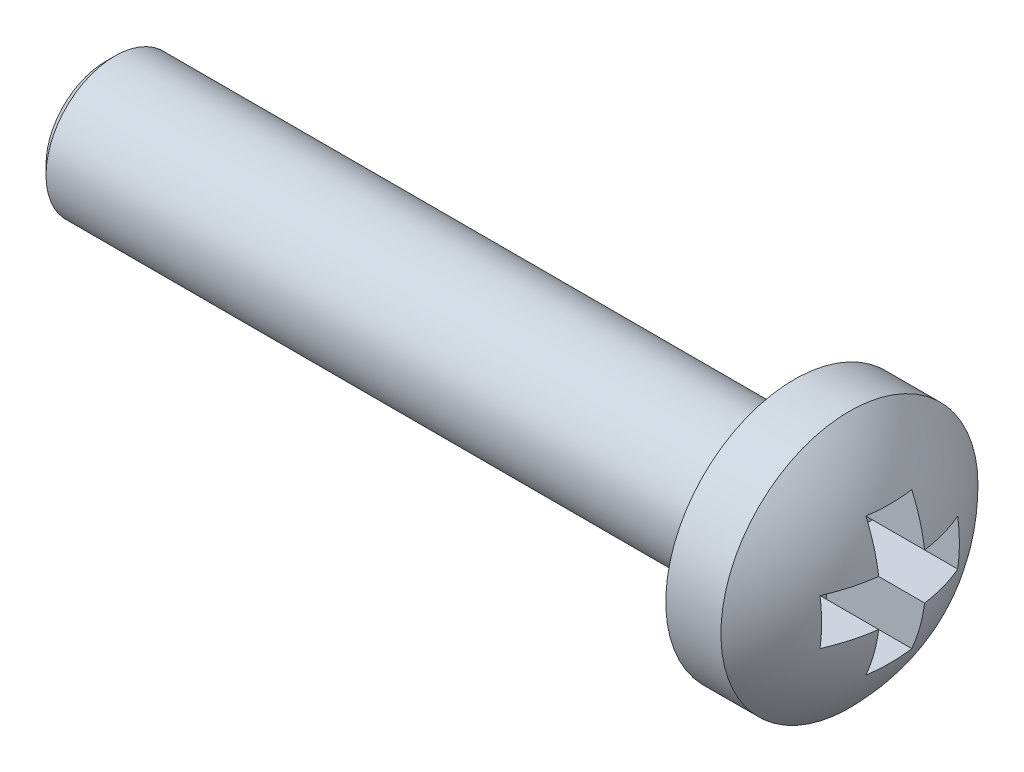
ISO-10303-21;
HEADER;
FILE_DESCRIPTION(('STEP AP214'),'2;1');
FILE_NAME('part.step','',(''),(''),'','','');
FILE_SCHEMA(('AUTOMOTIVE_DESIGN { 1 0 10303 214 1 1 1 1 }'));
ENDSEC;
DATA;
#1=APPLICATION_CONTEXT('core data for automotive mechanical design processes');
#2=APPLICATION_PROTOCOL_DEFINITION('international standard','automotive_design',2000,#1);
#3=PRODUCT_CONTEXT('',#1,'mechanical');
#4=PRODUCT('Part','Part','',(#3));
#5=PRODUCT_RELATED_PRODUCT_CATEGORY('part','',(#4));
#6=PRODUCT_DEFINITION_FORMATION('','',#4);
#7=PRODUCT_DEFINITION_CONTEXT('part definition',#1,'design');
#8=PRODUCT_DEFINITION('design','',#6,#7);
#9=PRODUCT_DEFINITION_SHAPE('','',#8);
#10=(LENGTH_UNIT() NAMED_UNIT(*) SI_UNIT(.MILLI.,.METRE.));
#11=(NAMED_UNIT(*) PLANE_ANGLE_UNIT() SI_UNIT($,.RADIAN.));
#12=(NAMED_UNIT(*) SI_UNIT($,.STERADIAN.) SOLID_ANGLE_UNIT());
#13=UNCERTAINTY_MEASURE_WITH_UNIT(LENGTH_MEASURE(1.E-05),#10,'distance_accuracy_value','');
#14=(GEOMETRIC_REPRESENTATION_CONTEXT(3) GLOBAL_UNCERTAINTY_ASSIGNED_CONTEXT((#13)) GLOBAL_UNIT_ASSIGNED_CONTEXT((#10,
#11,#12)) REPRESENTATION_CONTEXT('',''));
#15=CARTESIAN_POINT('',(0.,0.,0.));
#16=DIRECTION('',(0.,0.,1.));
#17=DIRECTION('',(1.,0.,0.));
#18=AXIS2_PLACEMENT_3D('',#15,#16,#17);
#19=CARTESIAN_POINT('',(2.4,0.,0.));
#20=CARTESIAN_POINT('',(2.4,-1.57169168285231,0.));
#21=CARTESIAN_POINT('',(1.2,-2.8,0.));
#22=B_SPLINE_CURVE_WITH_KNOTS('',2,(#19,#20,#21),.UNSPECIFIED.,.F.,.F.,(3,3),(0.,1.),.UNSPECIFIED.);
#23=CARTESIAN_POINT('',(11.0618266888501,0.,0.));
#24=DIRECTION('',(1.,0.,0.));
#25=AXIS1_PLACEMENT('',#23,#24);
#26=SURFACE_OF_REVOLUTION('',#22,#25);
#27=CARTESIAN_POINT('',(1.2,0.,0.));
#28=DIRECTION('',(1.,0.,0.));
#29=DIRECTION('',(0.,0.,-1.));
#30=AXIS2_PLACEMENT_3D('',#27,#28,#29);
#31=CIRCLE('',#30,2.8);
#32=CARTESIAN_POINT('',(1.2,0.,-2.8));
#33=VERTEX_POINT('',#32);
#34=EDGE_CURVE('E265',#33,#33,#31,.T.);
#35=ORIENTED_EDGE('',*,*,#34,.T.);
#36=EDGE_LOOP('',(#35));
#37=FACE_BOUND('',#36,.T.);
#38=CARTESIAN_POINT('',(2.05758661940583,0.500000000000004,1.49999999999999));
#39=CARTESIAN_POINT('',(2.08308448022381,0.500000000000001,1.44179657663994));
#40=CARTESIAN_POINT('',(2.10709470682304,0.5,1.38295700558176));
#41=CARTESIAN_POINT('',(2.1520554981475,0.5,1.26410705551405));
#42=CARTESIAN_POINT('',(2.17300544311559,0.5,1.204096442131));
#43=CARTESIAN_POINT('',(2.23082558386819,0.5,1.02342732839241));
#44=CARTESIAN_POINT('',(2.2630608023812,0.499999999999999,0.901232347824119));
#45=CARTESIAN_POINT('',(2.29852160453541,0.499999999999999,0.731861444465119));
#46=CARTESIAN_POINT('',(2.30725171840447,0.5,0.685768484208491));
#47=CARTESIAN_POINT('',(2.3229806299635,0.5,0.593159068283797));
#48=CARTESIAN_POINT('',(2.32997465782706,0.5,0.546641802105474));
#49=CARTESIAN_POINT('',(2.33609517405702,0.5,0.500000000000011));
#50=B_SPLINE_CURVE_WITH_KNOTS('',3,(#38,#39,#40,#41,#42,#43,#44,#45,#46,#47,#48,#49),
.UNSPECIFIED.,.F.,.F.,(4,2,2,2,2,4),(0.,0.190580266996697,0.381199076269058,0.759504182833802,
0.900218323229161,1.04131489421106),.UNSPECIFIED.);
#51=CARTESIAN_POINT('',(2.05758661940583,0.5,1.5));
#52=VERTEX_POINT('',#51);
#53=CARTESIAN_POINT('',(2.33609517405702,0.5,0.500000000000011));
#54=VERTEX_POINT('',#53);
#55=EDGE_CURVE('E167',#52,#54,#50,.T.);
#56=ORIENTED_EDGE('',*,*,#55,.T.);
#57=CARTESIAN_POINT('',(2.33609517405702,0.5,0.500000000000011));
#58=CARTESIAN_POINT('',(2.32797490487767,0.561927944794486,0.500000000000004));
#59=CARTESIAN_POINT('',(2.31830112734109,0.623654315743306,0.500000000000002));
#60=CARTESIAN_POINT('',(2.29584316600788,0.746540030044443,0.499999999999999));
#61=CARTESIAN_POINT('',(2.28305889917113,0.807699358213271,0.5));
#62=CARTESIAN_POINT('',(2.25447928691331,0.928850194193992,0.500000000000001));
#63=CARTESIAN_POINT('',(2.23870606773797,0.988846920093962,0.500000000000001));
#64=CARTESIAN_POINT('',(2.20412521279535,1.10795747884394,0.5));
#65=CARTESIAN_POINT('',(2.1853177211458,1.16707135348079,0.5));
#66=CARTESIAN_POINT('',(2.14895095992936,1.27208335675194,0.5));
#67=CARTESIAN_POINT('',(2.13194503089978,1.3181740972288,0.5));
#68=CARTESIAN_POINT('',(2.09611683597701,1.40963903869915,0.500000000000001));
#69=CARTESIAN_POINT('',(2.07729474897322,1.45501330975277,0.500000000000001));
#70=CARTESIAN_POINT('',(2.05758661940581,1.5,0.5));
#71=B_SPLINE_CURVE_WITH_KNOTS('',3,(#57,#58,#59,#60,#61,#62,#63,#64,#65,#66,#67,#68,#69,#70),
.UNSPECIFIED.,.F.,.F.,(4,2,2,2,2,2,4),(0.,0.187357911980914,0.374720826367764,0.560747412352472,
0.746765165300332,0.894111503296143,1.0414433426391),.UNSPECIFIED.);
#72=CARTESIAN_POINT('',(2.05758661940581,1.5,0.5));
#73=VERTEX_POINT('',#72);
#74=EDGE_CURVE('E11',#54,#73,#71,.T.);
#75=ORIENTED_EDGE('',*,*,#74,.T.);
#76=CARTESIAN_POINT('',(2.05758661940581,1.5,0.500000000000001));
#77=CARTESIAN_POINT('',(2.07601190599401,1.5,0.374107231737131));
#78=CARTESIAN_POINT('',(2.08741865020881,1.5,0.247173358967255));
#79=CARTESIAN_POINT('',(2.09618340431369,1.5,-0.00617564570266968));
#80=CARTESIAN_POINT('',(2.09365159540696,1.5,-0.132586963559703));
#81=CARTESIAN_POINT('',(2.07818848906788,1.5,-0.339263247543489));
#82=CARTESIAN_POINT('',(2.0693049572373,1.5,-0.419846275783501));
#83=CARTESIAN_POINT('',(2.05758661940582,1.5,-0.499999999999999));
#84=B_SPLINE_CURVE_WITH_KNOTS('',3,(#76,#77,#78,#79,#80,#81,#82,#83),.UNSPECIFIED.,.F.,.F.,(4,2,
2,4),(0.,0.381541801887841,0.760071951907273,1.00308018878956),.UNSPECIFIED.);
#85=CARTESIAN_POINT('',(2.05758661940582,1.5,-0.5));
#86=VERTEX_POINT('',#85);
#87=EDGE_CURVE('E45',#73,#86,#84,.T.);
#88=ORIENTED_EDGE('',*,*,#87,.T.);
#89=CARTESIAN_POINT('',(2.05758661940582,1.5,-0.499999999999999));
#90=CARTESIAN_POINT('',(2.08308448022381,1.44179657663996,-0.499999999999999));
#91=CARTESIAN_POINT('',(2.10709470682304,1.38295700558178,-0.5));
#92=CARTESIAN_POINT('',(2.1520554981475,1.26410705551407,-0.5));
#93=CARTESIAN_POINT('',(2.17300544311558,1.20409644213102,-0.5));
#94=CARTESIAN_POINT('',(2.23082558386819,1.02342732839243,-0.499999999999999));
#95=CARTESIAN_POINT('',(2.2630608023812,0.901232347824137,-0.499999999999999));
#96=CARTESIAN_POINT('',(2.29852160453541,0.731861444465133,-0.499999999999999));
#97=CARTESIAN_POINT('',(2.30725171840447,0.685768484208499,-0.499999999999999));
#98=CARTESIAN_POINT('',(2.3229806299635,0.593159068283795,-0.5));
#99=CARTESIAN_POINT('',(2.32997465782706,0.546641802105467,-0.5));
#100=CARTESIAN_POINT('',(2.33609517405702,0.5,-0.5));
#101=B_SPLINE_CURVE_WITH_KNOTS('',3,(#89,#90,#91,#92,#93,#94,#95,#96,#97,#98,#99,#100),
.UNSPECIFIED.,.F.,.F.,(4,2,2,2,2,4),(0.,0.190580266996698,0.381199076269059,0.759504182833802,
0.900218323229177,1.04131489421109),.UNSPECIFIED.);
#102=CARTESIAN_POINT('',(2.33609517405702,0.5,-0.5));
#103=VERTEX_POINT('',#102);
#104=EDGE_CURVE('E231',#86,#103,#101,.T.);
#105=ORIENTED_EDGE('',*,*,#104,.T.);
#106=CARTESIAN_POINT('',(2.33609517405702,0.5,-0.5));
#107=CARTESIAN_POINT('',(2.32797490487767,0.5,-0.561927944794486));
#108=CARTESIAN_POINT('',(2.31830112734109,0.5,-0.623654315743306));
#109=CARTESIAN_POINT('',(2.29584316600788,0.5,-0.746540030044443));
#110=CARTESIAN_POINT('',(2.28305889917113,0.5,-0.807699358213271));
#111=CARTESIAN_POINT('',(2.25447928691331,0.5,-0.928850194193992));
#112=CARTESIAN_POINT('',(2.23870606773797,0.5,-0.988846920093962));
#113=CARTESIAN_POINT('',(2.20412521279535,0.5,-1.10795747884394));
#114=CARTESIAN_POINT('',(2.1853177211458,0.5,-1.16707135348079));
#115=CARTESIAN_POINT('',(2.14895095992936,0.5,-1.27208335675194));
#116=CARTESIAN_POINT('',(2.13194503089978,0.5,-1.31817409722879));
#117=CARTESIAN_POINT('',(2.09611683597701,0.5,-1.40963903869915));
#118=CARTESIAN_POINT('',(2.07729474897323,0.5,-1.45501330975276));
#119=CARTESIAN_POINT('',(2.05758661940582,0.5,-1.49999999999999));
#120=B_SPLINE_CURVE_WITH_KNOTS('',3,(#106,#107,#108,#109,#110,#111,#112,#113,#114,#115,#116,
#117,#118,#119),.UNSPECIFIED.,.F.,.F.,(4,2,2,2,2,2,4),(0.,0.187357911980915,0.374720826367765,
0.560747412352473,0.746765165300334,0.894111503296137,1.04144334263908),.UNSPECIFIED.);
#121=CARTESIAN_POINT('',(2.05758661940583,0.5,-1.5));
#122=VERTEX_POINT('',#121);
#123=EDGE_CURVE('E225',#103,#122,#120,.T.);
#124=ORIENTED_EDGE('',*,*,#123,.T.);
#125=CARTESIAN_POINT('',(2.05758661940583,0.500000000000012,-1.49999999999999));
#126=CARTESIAN_POINT('',(2.07601190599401,0.374107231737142,-1.5));
#127=CARTESIAN_POINT('',(2.0874186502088,0.247173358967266,-1.5));
#128=CARTESIAN_POINT('',(2.09618340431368,-0.00617564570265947,-1.5));
#129=CARTESIAN_POINT('',(2.09365159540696,-0.132586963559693,-1.5));
#130=CARTESIAN_POINT('',(2.07818848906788,-0.339263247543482,-1.5));
#131=CARTESIAN_POINT('',(2.0693049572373,-0.419846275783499,-1.5));
#132=CARTESIAN_POINT('',(2.05758661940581,-0.500000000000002,-1.5));
#133=B_SPLINE_CURVE_WITH_KNOTS('',3,(#125,#126,#127,#128,#129,#130,#131,#132),.UNSPECIFIED.,.F.,
.F.,(4,2,2,4),(0.,0.38154180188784,0.760071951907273,1.00308018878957),.UNSPECIFIED.);
#134=CARTESIAN_POINT('',(2.05758661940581,-0.5,-1.5));
#135=VERTEX_POINT('',#134);
#136=EDGE_CURVE('E218',#122,#135,#133,.T.);
#137=ORIENTED_EDGE('',*,*,#136,.T.);
#138=CARTESIAN_POINT('',(2.05758661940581,-0.500000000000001,-1.5));
#139=CARTESIAN_POINT('',(2.0830844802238,-0.5,-1.44179657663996));
#140=CARTESIAN_POINT('',(2.10709470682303,-0.5,-1.38295700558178));
#141=CARTESIAN_POINT('',(2.1520554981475,-0.5,-1.26410705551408));
#142=CARTESIAN_POINT('',(2.17300544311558,-0.5,-1.20409644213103));
#143=CARTESIAN_POINT('',(2.23082558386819,-0.5,-1.02342732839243));
#144=CARTESIAN_POINT('',(2.2630608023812,-0.499999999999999,-0.901232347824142));
#145=CARTESIAN_POINT('',(2.29852160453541,-0.5,-0.731861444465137));
#146=CARTESIAN_POINT('',(2.30725171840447,-0.5,-0.685768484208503));
#147=CARTESIAN_POINT('',(2.3229806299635,-0.5,-0.593159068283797));
#148=CARTESIAN_POINT('',(2.32997465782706,-0.5,-0.546641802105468));
#149=CARTESIAN_POINT('',(2.33609517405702,-0.5,-0.5));
#150=B_SPLINE_CURVE_WITH_KNOTS('',3,(#138,#139,#140,#141,#142,#143,#144,#145,#146,#147,#148,
#149),.UNSPECIFIED.,.F.,.F.,(4,2,2,2,2,4),(0.,0.190580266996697,0.381199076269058,
0.759504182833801,0.900218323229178,1.0413148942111),.UNSPECIFIED.);
#151=CARTESIAN_POINT('',(2.33609517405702,-0.5,-0.5));
#152=VERTEX_POINT('',#151);
#153=EDGE_CURVE('E211',#135,#152,#150,.T.);
#154=ORIENTED_EDGE('',*,*,#153,.T.);
#155=CARTESIAN_POINT('',(2.33609517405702,-0.5,-0.5));
#156=CARTESIAN_POINT('',(2.32797490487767,-0.561927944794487,-0.5));
#157=CARTESIAN_POINT('',(2.31830112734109,-0.623654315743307,-0.5));
#158=CARTESIAN_POINT('',(2.29584316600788,-0.746540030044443,-0.5));
#159=CARTESIAN_POINT('',(2.28305889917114,-0.807699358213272,-0.5));
#160=CARTESIAN_POINT('',(2.25447928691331,-0.928850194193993,-0.5));
#161=CARTESIAN_POINT('',(2.23870606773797,-0.988846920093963,-0.5));
#162=CARTESIAN_POINT('',(2.20412521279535,-1.10795747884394,-0.5));
#163=CARTESIAN_POINT('',(2.1853177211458,-1.16707135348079,-0.5));
#164=CARTESIAN_POINT('',(2.14895095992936,-1.27208335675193,-0.5));
#165=CARTESIAN_POINT('',(2.13194503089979,-1.31817409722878,-0.5));
#166=CARTESIAN_POINT('',(2.09611683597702,-1.40963903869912,-0.499999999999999));
#167=CARTESIAN_POINT('',(2.07729474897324,-1.45501330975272,-0.499999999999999));
#168=CARTESIAN_POINT('',(2.05758661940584,-1.49999999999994,-0.499999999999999));
#169=B_SPLINE_CURVE_WITH_KNOTS('',3,(#155,#156,#157,#158,#159,#160,#161,#162,#163,#164,#165,
#166,#167,#168),.UNSPECIFIED.,.F.,.F.,(4,2,2,2,2,2,4),(0.,0.187357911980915,0.374720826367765,
0.560747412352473,0.746765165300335,0.894111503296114,1.04144334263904),.UNSPECIFIED.);
#170=CARTESIAN_POINT('',(2.05758661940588,-1.5,-0.5));
#171=VERTEX_POINT('',#170);
#172=EDGE_CURVE('E204',#152,#171,#169,.T.);
#173=ORIENTED_EDGE('',*,*,#172,.T.);
#174=CARTESIAN_POINT('',(2.05758661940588,-1.49999999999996,-0.499999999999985));
#175=CARTESIAN_POINT('',(2.07601190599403,-1.49999999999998,-0.374107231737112));
#176=CARTESIAN_POINT('',(2.08741865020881,-1.5,-0.247173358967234));
#177=CARTESIAN_POINT('',(2.09618340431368,-1.5,0.00617564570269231));
#178=CARTESIAN_POINT('',(2.09365159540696,-1.5,0.132586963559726));
#179=CARTESIAN_POINT('',(2.07818848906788,-1.5,0.339263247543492));
#180=CARTESIAN_POINT('',(2.06930495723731,-1.5,0.419846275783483));
#181=CARTESIAN_POINT('',(2.05758661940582,-1.5,0.499999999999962));
#182=B_SPLINE_CURVE_WITH_KNOTS('',3,(#174,#175,#176,#177,#178,#179,#180,#181),.UNSPECIFIED.,.F.,
.F.,(4,2,2,4),(0.,0.38154180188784,0.760071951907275,1.0030801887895),.UNSPECIFIED.);
#183=CARTESIAN_POINT('',(2.05758661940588,-1.5,0.5));
#184=VERTEX_POINT('',#183);
#185=EDGE_CURVE('E197',#171,#184,#182,.T.);
#186=ORIENTED_EDGE('',*,*,#185,.T.);
#187=CARTESIAN_POINT('',(2.05758661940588,-1.49999999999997,0.499999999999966));
#188=CARTESIAN_POINT('',(2.08308448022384,-1.44179657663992,0.499999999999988));
#189=CARTESIAN_POINT('',(2.10709470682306,-1.38295700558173,0.499999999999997));
#190=CARTESIAN_POINT('',(2.15205549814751,-1.26410705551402,0.500000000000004));
#191=CARTESIAN_POINT('',(2.1730054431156,-1.20409644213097,0.500000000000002));
#192=CARTESIAN_POINT('',(2.2308255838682,-1.02342732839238,0.499999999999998));
#193=CARTESIAN_POINT('',(2.26306080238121,-0.901232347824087,0.499999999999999));
#194=CARTESIAN_POINT('',(2.29852160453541,-0.73186144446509,0.5));
#195=CARTESIAN_POINT('',(2.30725171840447,-0.685768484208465,0.5));
#196=CARTESIAN_POINT('',(2.3229806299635,-0.593159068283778,0.500000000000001));
#197=CARTESIAN_POINT('',(2.32997465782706,-0.546641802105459,0.500000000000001));
#198=CARTESIAN_POINT('',(2.33609517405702,-0.5,0.5));
#199=B_SPLINE_CURVE_WITH_KNOTS('',3,(#187,#188,#189,#190,#191,#192,#193,#194,#195,#196,#197,
#198),.UNSPECIFIED.,.F.,.F.,(4,2,2,2,2,4),(0.,0.190580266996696,0.381199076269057,
0.759504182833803,0.900218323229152,1.04131489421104),.UNSPECIFIED.);
#200=CARTESIAN_POINT('',(2.33609517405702,-0.5,0.5));
#201=VERTEX_POINT('',#200);
#202=EDGE_CURVE('E190',#184,#201,#199,.T.);
#203=ORIENTED_EDGE('',*,*,#202,.T.);
#204=CARTESIAN_POINT('',(2.33609517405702,-0.5,0.5));
#205=CARTESIAN_POINT('',(2.32797490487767,-0.5,0.561927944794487));
#206=CARTESIAN_POINT('',(2.31830112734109,-0.5,0.623654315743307));
#207=CARTESIAN_POINT('',(2.29584316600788,-0.5,0.746540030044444));
#208=CARTESIAN_POINT('',(2.28305889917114,-0.5,0.807699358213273));
#209=CARTESIAN_POINT('',(2.25447928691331,-0.5,0.928850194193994));
#210=CARTESIAN_POINT('',(2.23870606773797,-0.5,0.988846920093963));
#211=CARTESIAN_POINT('',(2.20412521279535,-0.5,1.10795747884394));
#212=CARTESIAN_POINT('',(2.1853177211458,-0.500000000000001,1.16707135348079));
#213=CARTESIAN_POINT('',(2.14895095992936,-0.500000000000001,1.27208335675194));
#214=CARTESIAN_POINT('',(2.13194503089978,-0.5,1.3181740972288));
#215=CARTESIAN_POINT('',(2.09611683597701,-0.5,1.40963903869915));
#216=CARTESIAN_POINT('',(2.07729474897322,-0.5,1.45501330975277));
#217=CARTESIAN_POINT('',(2.05758661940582,-0.500000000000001,1.5));
#218=B_SPLINE_CURVE_WITH_KNOTS('',3,(#204,#205,#206,#207,#208,#209,#210,#211,#212,#213,#214,
#215,#216,#217),.UNSPECIFIED.,.F.,.F.,(4,2,2,2,2,2,4),(0.,0.187357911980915,0.374720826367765,
0.560747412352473,0.746765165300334,0.894111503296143,1.0414433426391),.UNSPECIFIED.);
#219=CARTESIAN_POINT('',(2.05758661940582,-0.5,1.5));
#220=VERTEX_POINT('',#219);
#221=EDGE_CURVE('E183',#201,#220,#218,.T.);
#222=ORIENTED_EDGE('',*,*,#221,.T.);
#223=CARTESIAN_POINT('',(2.05758661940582,-0.499999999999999,1.5));
#224=CARTESIAN_POINT('',(2.07601190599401,-0.374107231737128,1.5));
#225=CARTESIAN_POINT('',(2.0874186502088,-0.247173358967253,1.5));
#226=CARTESIAN_POINT('',(2.09618340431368,0.00617564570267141,1.5));
#227=CARTESIAN_POINT('',(2.09365159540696,0.132586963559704,1.5));
#228=CARTESIAN_POINT('',(2.07818848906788,0.339263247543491,1.5));
#229=CARTESIAN_POINT('',(2.0693049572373,0.419846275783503,1.5));
#230=CARTESIAN_POINT('',(2.05758661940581,0.500000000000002,1.5));
#231=B_SPLINE_CURVE_WITH_KNOTS('',3,(#223,#224,#225,#226,#227,#228,#229,#230),.UNSPECIFIED.,.F.,
.F.,(4,2,2,4),(0.,0.38154180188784,0.760071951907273,1.00308018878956),.UNSPECIFIED.);
#232=EDGE_CURVE('E176',#220,#52,#231,.T.);
#233=ORIENTED_EDGE('',*,*,#232,.T.);
#234=EDGE_LOOP('',(#56,#75,#88,#105,#124,#137,#154,#173,#186,#203,#222,#233));
#235=FACE_BOUND('',#234,.T.);
#236=ADVANCED_FACE('F33',(#37,#235),#26,.F.);
#237=CARTESIAN_POINT('',(11.0618266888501,0.,0.));
#238=DIRECTION('',(1.,0.,0.));
#239=DIRECTION('',(0.,0.,-1.));
#240=AXIS2_PLACEMENT_3D('',#237,#238,#239);
#241=CYLINDRICAL_SURFACE('',#240,2.8);
#242=CARTESIAN_POINT('',(0.,0.,0.));
#243=DIRECTION('',(1.,0.,0.));
#244=DIRECTION('',(0.,0.,-1.));
#245=AXIS2_PLACEMENT_3D('',#242,#243,#244);
#246=CIRCLE('',#245,2.8);
#247=CARTESIAN_POINT('',(0.,0.,-2.8));
#248=VERTEX_POINT('',#247);
#249=EDGE_CURVE('E145',#248,#248,#246,.T.);
#250=ORIENTED_EDGE('',*,*,#249,.T.);
#251=EDGE_LOOP('',(#250));
#252=FACE_BOUND('',#251,.T.);
#253=ORIENTED_EDGE('',*,*,#34,.F.);
#254=EDGE_LOOP('',(#253));
#255=FACE_BOUND('',#254,.T.);
#256=ADVANCED_FACE('F161',(#252,#255),#241,.T.);
#257=CARTESIAN_POINT('',(0.,-1.5,0.));
#258=DIRECTION('',(-1.,0.,0.));
#259=DIRECTION('',(0.,0.,1.));
#260=AXIS2_PLACEMENT_3D('',#257,#258,#259);
#261=PLANE('',#260);
#262=CARTESIAN_POINT('',(0.,0.,0.));
#263=DIRECTION('',(1.,0.,0.));
#264=DIRECTION('',(0.,0.,-1.));
#265=AXIS2_PLACEMENT_3D('',#262,#263,#264);
#266=CIRCLE('',#265,1.5);
#267=CARTESIAN_POINT('',(0.,0.,-1.5));
#268=VERTEX_POINT('',#267);
#269=EDGE_CURVE('E141',#268,#268,#266,.T.);
#270=ORIENTED_EDGE('',*,*,#269,.T.);
#271=EDGE_LOOP('',(#270));
#272=FACE_BOUND('',#271,.T.);
#273=ORIENTED_EDGE('',*,*,#249,.F.);
#274=EDGE_LOOP('',(#273));
#275=FACE_BOUND('',#274,.T.);
#276=ADVANCED_FACE('F253',(#272,#275),#261,.T.);
#277=CARTESIAN_POINT('',(11.0618266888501,0.,0.));
#278=DIRECTION('',(1.,0.,0.));
#279=DIRECTION('',(0.,0.,-1.));
#280=AXIS2_PLACEMENT_3D('',#277,#278,#279);
#281=CYLINDRICAL_SURFACE('',#280,1.5);
#282=CARTESIAN_POINT('',(-14.8,0.,0.));
#283=DIRECTION('',(-1.,0.,0.));
#284=DIRECTION('',(0.,0.,1.));
#285=AXIS2_PLACEMENT_3D('',#282,#283,#284);
#286=CIRCLE('',#285,1.5);
#287=CARTESIAN_POINT('',(-14.8,0.,1.5));
#288=VERTEX_POINT('',#287);
#289=EDGE_CURVE('E267',#288,#288,#286,.F.);
#290=ORIENTED_EDGE('',*,*,#289,.T.);
#291=EDGE_LOOP('',(#290));
#292=FACE_BOUND('',#291,.T.);
#293=ORIENTED_EDGE('',*,*,#269,.F.);
#294=EDGE_LOOP('',(#293));
#295=FACE_BOUND('',#294,.T.);
#296=ADVANCED_FACE('F250',(#292,#295),#281,.T.);
#297=CARTESIAN_POINT('',(-15.,-1.5,0.));
#298=DIRECTION('',(-1.,0.,0.));
#299=DIRECTION('',(0.,0.,1.));
#300=AXIS2_PLACEMENT_3D('',#297,#298,#299);
#301=PLANE('',#300);
#302=CARTESIAN_POINT('',(-15.,0.,0.));
#303=DIRECTION('',(-1.,0.,0.));
#304=DIRECTION('',(0.,0.,1.));
#305=AXIS2_PLACEMENT_3D('',#302,#303,#304);
#306=CIRCLE('',#305,1.29999999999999);
#307=CARTESIAN_POINT('',(-15.,0.,1.29999999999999));
#308=VERTEX_POINT('',#307);
#309=EDGE_CURVE('E271',#308,#308,#306,.T.);
#310=ORIENTED_EDGE('',*,*,#309,.T.);
#311=EDGE_LOOP('',(#310));
#312=FACE_BOUND('',#311,.T.);
#313=ADVANCED_FACE('F247',(#312),#301,.T.);
#314=CARTESIAN_POINT('',(-14.8,0.,0.));
#315=DIRECTION('',(1.,0.,0.));
#316=DIRECTION('',(0.,0.,-1.));
#317=AXIS2_PLACEMENT_3D('',#314,#315,#316);
#318=CONICAL_SURFACE('',#317,1.5,0.785398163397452);
#319=ORIENTED_EDGE('',*,*,#309,.F.);
#320=EDGE_LOOP('',(#319));
#321=FACE_BOUND('',#320,.T.);
#322=ORIENTED_EDGE('',*,*,#289,.F.);
#323=EDGE_LOOP('',(#322));
#324=FACE_BOUND('',#323,.T.);
#325=ADVANCED_FACE('F35',(#321,#324),#318,.T.);
#326=CARTESIAN_POINT('',(0.2,1.5,0.5));
#327=DIRECTION('',(0.,0.,-1.));
#328=DIRECTION('',(-1.,0.,0.));
#329=AXIS2_PLACEMENT_3D('',#326,#327,#328);
#330=PLANE('',#329);
#331=DIRECTION('',(1.,0.,0.));
#332=VECTOR('',#331,1.);
#333=CARTESIAN_POINT('',(0.2,0.5,0.5));
#334=LINE('',#333,#332);
#335=CARTESIAN_POINT('',(0.2,0.5,0.5));
#336=VERTEX_POINT('',#335);
#337=EDGE_CURVE('E52',#336,#54,#334,.T.);
#338=ORIENTED_EDGE('',*,*,#337,.F.);
#339=DIRECTION('',(0.,1.,0.));
#340=VECTOR('',#339,1.);
#341=CARTESIAN_POINT('',(0.2,1.5,0.5));
#342=LINE('',#341,#340);
#343=CARTESIAN_POINT('',(0.2,1.5,0.5));
#344=VERTEX_POINT('',#343);
#345=EDGE_CURVE('E131',#336,#344,#342,.T.);
#346=ORIENTED_EDGE('',*,*,#345,.T.);
#347=DIRECTION('',(1.,0.,0.));
#348=VECTOR('',#347,1.);
#349=CARTESIAN_POINT('',(0.2,1.5,0.5));
#350=LINE('',#349,#348);
#351=EDGE_CURVE('E138',#344,#73,#350,.T.);
#352=ORIENTED_EDGE('',*,*,#351,.T.);
#353=ORIENTED_EDGE('',*,*,#74,.F.);
#354=EDGE_LOOP('',(#338,#346,#352,#353));
#355=FACE_BOUND('',#354,.T.);
#356=ADVANCED_FACE('F137',(#355),#330,.T.);
#357=CARTESIAN_POINT('',(0.2,1.5,0.5));
#358=DIRECTION('',(0.,-1.,0.));
#359=DIRECTION('',(0.,0.,-1.));
#360=AXIS2_PLACEMENT_3D('',#357,#358,#359);
#361=PLANE('',#360);
#362=ORIENTED_EDGE('',*,*,#351,.F.);
#363=DIRECTION('',(0.,0.,-1.));
#364=VECTOR('',#363,1.);
#365=CARTESIAN_POINT('',(0.2,1.5,0.5));
#366=LINE('',#365,#364);
#367=CARTESIAN_POINT('',(0.2,1.5,-0.5));
#368=VERTEX_POINT('',#367);
#369=EDGE_CURVE('E127',#344,#368,#366,.T.);
#370=ORIENTED_EDGE('',*,*,#369,.T.);
#371=DIRECTION('',(1.,0.,0.));
#372=VECTOR('',#371,1.);
#373=CARTESIAN_POINT('',(0.2,1.5,-0.5));
#374=LINE('',#373,#372);
#375=EDGE_CURVE('E142',#368,#86,#374,.T.);
#376=ORIENTED_EDGE('',*,*,#375,.T.);
#377=ORIENTED_EDGE('',*,*,#87,.F.);
#378=EDGE_LOOP('',(#362,#370,#376,#377));
#379=FACE_BOUND('',#378,.T.);
#380=ADVANCED_FACE('F140',(#379),#361,.T.);
#381=CARTESIAN_POINT('',(0.2,1.5,-0.5));
#382=DIRECTION('',(0.,0.,1.));
#383=DIRECTION('',(1.,0.,0.));
#384=AXIS2_PLACEMENT_3D('',#381,#382,#383);
#385=PLANE('',#384);
#386=ORIENTED_EDGE('',*,*,#375,.F.);
#387=DIRECTION('',(0.,-1.,0.));
#388=VECTOR('',#387,1.);
#389=CARTESIAN_POINT('',(0.2,1.5,-0.5));
#390=LINE('',#389,#388);
#391=CARTESIAN_POINT('',(0.2,0.5,-0.5));
#392=VERTEX_POINT('',#391);
#393=EDGE_CURVE('E133',#368,#392,#390,.T.);
#394=ORIENTED_EDGE('',*,*,#393,.T.);
#395=DIRECTION('',(1.,0.,0.));
#396=VECTOR('',#395,1.);
#397=CARTESIAN_POINT('',(0.2,0.5,-0.5));
#398=LINE('',#397,#396);
#399=EDGE_CURVE('E147',#392,#103,#398,.T.);
#400=ORIENTED_EDGE('',*,*,#399,.T.);
#401=ORIENTED_EDGE('',*,*,#104,.F.);
#402=EDGE_LOOP('',(#386,#394,#400,#401));
#403=FACE_BOUND('',#402,.T.);
#404=ADVANCED_FACE('F242',(#403),#385,.T.);
#405=CARTESIAN_POINT('',(0.2,0.5,-0.5));
#406=DIRECTION('',(0.,-1.,0.));
#407=DIRECTION('',(0.,0.,-1.));
#408=AXIS2_PLACEMENT_3D('',#405,#406,#407);
#409=PLANE('',#408);
#410=ORIENTED_EDGE('',*,*,#399,.F.);
#411=DIRECTION('',(0.,0.,-1.));
#412=VECTOR('',#411,1.);
#413=CARTESIAN_POINT('',(0.2,0.5,-0.5));
#414=LINE('',#413,#412);
#415=CARTESIAN_POINT('',(0.2,0.5,-1.5));
#416=VERTEX_POINT('',#415);
#417=EDGE_CURVE('E331',#392,#416,#414,.T.);
#418=ORIENTED_EDGE('',*,*,#417,.T.);
#419=DIRECTION('',(1.,0.,0.));
#420=VECTOR('',#419,1.);
#421=CARTESIAN_POINT('',(0.2,0.5,-1.5));
#422=LINE('',#421,#420);
#423=EDGE_CURVE('E289',#416,#122,#422,.T.);
#424=ORIENTED_EDGE('',*,*,#423,.T.);
#425=ORIENTED_EDGE('',*,*,#123,.F.);
#426=EDGE_LOOP('',(#410,#418,#424,#425));
#427=FACE_BOUND('',#426,.T.);
#428=ADVANCED_FACE('F334',(#427),#409,.T.);
#429=CARTESIAN_POINT('',(0.2,0.5,-1.5));
#430=DIRECTION('',(0.,0.,1.));
#431=DIRECTION('',(1.,0.,0.));
#432=AXIS2_PLACEMENT_3D('',#429,#430,#431);
#433=PLANE('',#432);
#434=ORIENTED_EDGE('',*,*,#423,.F.);
#435=DIRECTION('',(0.,-1.,0.));
#436=VECTOR('',#435,1.);
#437=CARTESIAN_POINT('',(0.2,0.5,-1.5));
#438=LINE('',#437,#436);
#439=CARTESIAN_POINT('',(0.2,-0.5,-1.5));
#440=VERTEX_POINT('',#439);
#441=EDGE_CURVE('E329',#416,#440,#438,.T.);
#442=ORIENTED_EDGE('',*,*,#441,.T.);
#443=DIRECTION('',(1.,0.,0.));
#444=VECTOR('',#443,1.);
#445=CARTESIAN_POINT('',(0.2,-0.5,-1.5));
#446=LINE('',#445,#444);
#447=EDGE_CURVE('E291',#440,#135,#446,.T.);
#448=ORIENTED_EDGE('',*,*,#447,.T.);
#449=ORIENTED_EDGE('',*,*,#136,.F.);
#450=EDGE_LOOP('',(#434,#442,#448,#449));
#451=FACE_BOUND('',#450,.T.);
#452=ADVANCED_FACE('F337',(#451),#433,.T.);
#453=CARTESIAN_POINT('',(0.2,-0.5,-0.5));
#454=DIRECTION('',(0.,1.,0.));
#455=DIRECTION('',(0.,0.,1.));
#456=AXIS2_PLACEMENT_3D('',#453,#454,#455);
#457=PLANE('',#456);
#458=ORIENTED_EDGE('',*,*,#447,.F.);
#459=DIRECTION('',(0.,0.,1.));
#460=VECTOR('',#459,1.);
#461=CARTESIAN_POINT('',(0.2,-0.5,-0.5));
#462=LINE('',#461,#460);
#463=CARTESIAN_POINT('',(0.2,-0.5,-0.5));
#464=VERTEX_POINT('',#463);
#465=EDGE_CURVE('E327',#440,#464,#462,.T.);
#466=ORIENTED_EDGE('',*,*,#465,.T.);
#467=DIRECTION('',(1.,0.,0.));
#468=VECTOR('',#467,1.);
#469=CARTESIAN_POINT('',(0.2,-0.5,-0.5));
#470=LINE('',#469,#468);
#471=EDGE_CURVE('E296',#464,#152,#470,.T.);
#472=ORIENTED_EDGE('',*,*,#471,.T.);
#473=ORIENTED_EDGE('',*,*,#153,.F.);
#474=EDGE_LOOP('',(#458,#466,#472,#473));
#475=FACE_BOUND('',#474,.T.);
#476=ADVANCED_FACE('F344',(#475),#457,.T.);
#477=CARTESIAN_POINT('',(0.2,-0.5,-0.5));
#478=DIRECTION('',(0.,0.,1.));
#479=DIRECTION('',(0.,-1.,0.));
#480=AXIS2_PLACEMENT_3D('',#477,#478,#479);
#481=PLANE('',#480);
#482=ORIENTED_EDGE('',*,*,#471,.F.);
#483=DIRECTION('',(0.,-1.,0.));
#484=VECTOR('',#483,1.);
#485=CARTESIAN_POINT('',(0.2,-0.5,-0.5));
#486=LINE('',#485,#484);
#487=CARTESIAN_POINT('',(0.2,-1.5,-0.5));
#488=VERTEX_POINT('',#487);
#489=EDGE_CURVE('E325',#464,#488,#486,.T.);
#490=ORIENTED_EDGE('',*,*,#489,.T.);
#491=DIRECTION('',(1.,0.,0.));
#492=VECTOR('',#491,1.);
#493=CARTESIAN_POINT('',(0.2,-1.5,-0.5));
#494=LINE('',#493,#492);
#495=EDGE_CURVE('E299',#488,#171,#494,.T.);
#496=ORIENTED_EDGE('',*,*,#495,.T.);
#497=ORIENTED_EDGE('',*,*,#172,.F.);
#498=EDGE_LOOP('',(#482,#490,#496,#497));
#499=FACE_BOUND('',#498,.T.);
#500=ADVANCED_FACE('F346',(#499),#481,.T.);
#501=CARTESIAN_POINT('',(0.2,-1.5,0.5));
#502=DIRECTION('',(0.,1.,0.));
#503=DIRECTION('',(0.,0.,1.));
#504=AXIS2_PLACEMENT_3D('',#501,#502,#503);
#505=PLANE('',#504);
#506=ORIENTED_EDGE('',*,*,#495,.F.);
#507=DIRECTION('',(0.,0.,1.));
#508=VECTOR('',#507,1.);
#509=CARTESIAN_POINT('',(0.2,-1.5,0.5));
#510=LINE('',#509,#508);
#511=CARTESIAN_POINT('',(0.2,-1.5,0.5));
#512=VERTEX_POINT('',#511);
#513=EDGE_CURVE('E323',#488,#512,#510,.T.);
#514=ORIENTED_EDGE('',*,*,#513,.T.);
#515=DIRECTION('',(1.,0.,0.));
#516=VECTOR('',#515,1.);
#517=CARTESIAN_POINT('',(0.2,-1.5,0.5));
#518=LINE('',#517,#516);
#519=EDGE_CURVE('E302',#512,#184,#518,.T.);
#520=ORIENTED_EDGE('',*,*,#519,.T.);
#521=ORIENTED_EDGE('',*,*,#185,.F.);
#522=EDGE_LOOP('',(#506,#514,#520,#521));
#523=FACE_BOUND('',#522,.T.);
#524=ADVANCED_FACE('F349',(#523),#505,.T.);
#525=CARTESIAN_POINT('',(0.2,-0.5,0.5));
#526=DIRECTION('',(0.,0.,-1.));
#527=DIRECTION('',(-1.,0.,0.));
#528=AXIS2_PLACEMENT_3D('',#525,#526,#527);
#529=PLANE('',#528);
#530=ORIENTED_EDGE('',*,*,#519,.F.);
#531=DIRECTION('',(0.,1.,0.));
#532=VECTOR('',#531,1.);
#533=CARTESIAN_POINT('',(0.2,-0.5,0.5));
#534=LINE('',#533,#532);
#535=CARTESIAN_POINT('',(0.2,-0.5,0.5));
#536=VERTEX_POINT('',#535);
#537=EDGE_CURVE('E321',#512,#536,#534,.T.);
#538=ORIENTED_EDGE('',*,*,#537,.T.);
#539=DIRECTION('',(1.,0.,0.));
#540=VECTOR('',#539,1.);
#541=CARTESIAN_POINT('',(0.2,-0.5,0.5));
#542=LINE('',#541,#540);
#543=EDGE_CURVE('E305',#536,#201,#542,.T.);
#544=ORIENTED_EDGE('',*,*,#543,.T.);
#545=ORIENTED_EDGE('',*,*,#202,.F.);
#546=EDGE_LOOP('',(#530,#538,#544,#545));
#547=FACE_BOUND('',#546,.T.);
#548=ADVANCED_FACE('F356',(#547),#529,.T.);
#549=CARTESIAN_POINT('',(0.2,-0.5,1.5));
#550=DIRECTION('',(0.,1.,0.));
#551=DIRECTION('',(0.,0.,1.));
#552=AXIS2_PLACEMENT_3D('',#549,#550,#551);
#553=PLANE('',#552);
#554=ORIENTED_EDGE('',*,*,#543,.F.);
#555=DIRECTION('',(0.,0.,1.));
#556=VECTOR('',#555,1.);
#557=CARTESIAN_POINT('',(0.2,-0.5,1.5));
#558=LINE('',#557,#556);
#559=CARTESIAN_POINT('',(0.2,-0.5,1.5));
#560=VERTEX_POINT('',#559);
#561=EDGE_CURVE('E319',#536,#560,#558,.T.);
#562=ORIENTED_EDGE('',*,*,#561,.T.);
#563=DIRECTION('',(1.,0.,0.));
#564=VECTOR('',#563,1.);
#565=CARTESIAN_POINT('',(0.2,-0.5,1.5));
#566=LINE('',#565,#564);
#567=EDGE_CURVE('E308',#560,#220,#566,.T.);
#568=ORIENTED_EDGE('',*,*,#567,.T.);
#569=ORIENTED_EDGE('',*,*,#221,.F.);
#570=EDGE_LOOP('',(#554,#562,#568,#569));
#571=FACE_BOUND('',#570,.T.);
#572=ADVANCED_FACE('F358',(#571),#553,.T.);
#573=CARTESIAN_POINT('',(0.2,0.5,1.5));
#574=DIRECTION('',(0.,0.,-1.));
#575=DIRECTION('',(0.,1.,0.));
#576=AXIS2_PLACEMENT_3D('',#573,#574,#575);
#577=PLANE('',#576);
#578=ORIENTED_EDGE('',*,*,#567,.F.);
#579=DIRECTION('',(0.,1.,0.));
#580=VECTOR('',#579,1.);
#581=CARTESIAN_POINT('',(0.2,0.5,1.5));
#582=LINE('',#581,#580);
#583=CARTESIAN_POINT('',(0.2,0.5,1.5));
#584=VERTEX_POINT('',#583);
#585=EDGE_CURVE('E317',#560,#584,#582,.T.);
#586=ORIENTED_EDGE('',*,*,#585,.T.);
#587=DIRECTION('',(1.,0.,0.));
#588=VECTOR('',#587,1.);
#589=CARTESIAN_POINT('',(0.2,0.5,1.5));
#590=LINE('',#589,#588);
#591=EDGE_CURVE('E311',#584,#52,#590,.T.);
#592=ORIENTED_EDGE('',*,*,#591,.T.);
#593=ORIENTED_EDGE('',*,*,#232,.F.);
#594=EDGE_LOOP('',(#578,#586,#592,#593));
#595=FACE_BOUND('',#594,.T.);
#596=ADVANCED_FACE('F361',(#595),#577,.T.);
#597=CARTESIAN_POINT('',(0.2,0.5,1.5));
#598=DIRECTION('',(0.,-1.,0.));
#599=DIRECTION('',(0.,0.,-1.));
#600=AXIS2_PLACEMENT_3D('',#597,#598,#599);
#601=PLANE('',#600);
#602=ORIENTED_EDGE('',*,*,#591,.F.);
#603=DIRECTION('',(0.,0.,-1.));
#604=VECTOR('',#603,1.);
#605=CARTESIAN_POINT('',(0.2,0.5,1.5));
#606=LINE('',#605,#604);
#607=EDGE_CURVE('E315',#584,#336,#606,.T.);
#608=ORIENTED_EDGE('',*,*,#607,.T.);
#609=ORIENTED_EDGE('',*,*,#337,.T.);
#610=ORIENTED_EDGE('',*,*,#55,.F.);
#611=EDGE_LOOP('',(#602,#608,#609,#610));
#612=FACE_BOUND('',#611,.T.);
#613=ADVANCED_FACE('F363',(#612),#601,.T.);
#614=CARTESIAN_POINT('',(0.2,0.5,0.5));
#615=DIRECTION('',(1.,0.,0.));
#616=DIRECTION('',(0.,0.,-1.));
#617=AXIS2_PLACEMENT_3D('',#614,#615,#616);
#618=PLANE('',#617);
#619=ORIENTED_EDGE('',*,*,#345,.F.);
#620=ORIENTED_EDGE('',*,*,#607,.F.);
#621=ORIENTED_EDGE('',*,*,#585,.F.);
#622=ORIENTED_EDGE('',*,*,#561,.F.);
#623=ORIENTED_EDGE('',*,*,#537,.F.);
#624=ORIENTED_EDGE('',*,*,#513,.F.);
#625=ORIENTED_EDGE('',*,*,#489,.F.);
#626=ORIENTED_EDGE('',*,*,#465,.F.);
#627=ORIENTED_EDGE('',*,*,#441,.F.);
#628=ORIENTED_EDGE('',*,*,#417,.F.);
#629=ORIENTED_EDGE('',*,*,#393,.F.);
#630=ORIENTED_EDGE('',*,*,#369,.F.);
#631=EDGE_LOOP('',(#619,#620,#621,#622,#623,#624,#625,#626,#627,#628,#629,#630));
#632=FACE_BOUND('',#631,.T.);
#633=ADVANCED_FACE('F129',(#632),#618,.T.);
#634=CLOSED_SHELL('',(#236,#256,#276,#296,#313,#325,#356,#380,#404,#428,#452,#476,#500,#524,
#548,#572,#596,#613,#633));
#635=MANIFOLD_SOLID_BREP('B2',#634);
#636=ADVANCED_BREP_SHAPE_REPRESENTATION('',(#18,#635),#14);
#637=SHAPE_DEFINITION_REPRESENTATION(#9,#636);
ENDSEC;
END-ISO-10303-21;
